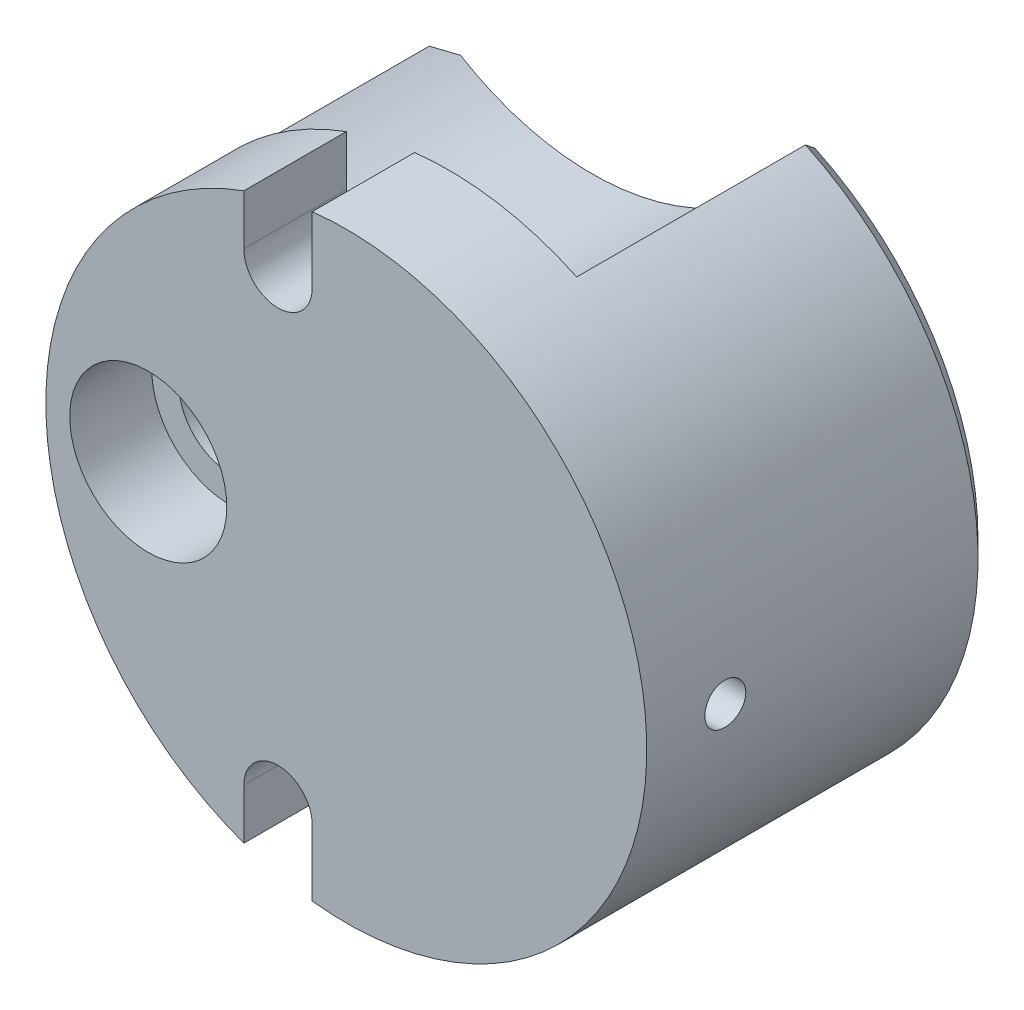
from build123d import *

# Parameters (mm, degrees)
ESQUISSE1_R                  = 44
BASE_EXTRUSION_DEPTH         = 51
CHANFREIN1_SIZE              = 2.5
ENL_V_MAT_EXTRU_1_REACH      = 103.959
ENL_V_MAT_EXTRU_1_END_RADIUS = 15
ESQUISSE4_R                  = 3
ENL_V_START                  = 36
ENL_V_MAT_EXTRU_4_DEPTH      = 36
ENL_V_MAT_EXTRU_3_REACH      = 73.889


with BuildPart() as part:
    # Esquisse1 → Base-Extrusion (new body)
    with BuildSketch(Plane.XY):
        Circle(ESQUISSE1_R)
    extrude(amount=-BASE_EXTRUSION_DEPTH)

    # Esquisse2 → Enl_vement de mati_re-R_volution1 (revolve, cut)
    with BuildSketch(Plane(origin=(0, 0, 0), x_dir=(1, 0, 0), z_dir=(0, 1, 0))):
        Polygon((-5, 51), (-5, 45), (-8, 45), (-8, 43), (-3.5, 43), (-3.5, 19), (-5.5, 19), (-5.5, 17), (1.5, 17), (1.5, 7), (16.5, 7), (16.5, 51), align=None)
    revolve(axis=Axis((16.5, 0, -5), (0, 0, 1)), mode=Mode.SUBTRACT)

    # Esquisse3 → Enl_vement de mati_re-R_volution2 (revolve, cut)
    with BuildSketch(Plane(origin=(0, 0, 0), x_dir=(1, 0, 0), z_dir=(0, 1, 0))):
        Polygon((-29, 51), (-29, 0), (-17.5, 0), (-17.5, 12), (-21.5, 12), (-21.5, 22), (-19, 22), (-19, 51), align=None)
    revolve(axis=Axis((-29, 0, 25), (0, 0, -1)), mode=Mode.SUBTRACT)

    # Chanfrein1
    chanfrein1_edges = [part.edges().sort_by_distance(p)[0] for p in [
        (-44, 0, -51),
    ]]
    chamfer(chanfrein1_edges, length=CHANFREIN1_SIZE)

    # Enl_v. mat.-Extru.1: up to this cylinder (the profile starts outside it)
    enl_v_mat_extru_1_end = Plane(origin=(16.5, 0, -11.5), z_dir=(0, 0, -1)) * Cylinder(ENL_V_MAT_EXTRU_1_END_RADIUS, 238.918, mode=Mode.PRIVATE)
    # Esquisse4 → Enl_v. mat.-Extru.1 (cut, up to the surface)
    with BuildSketch(Plane(origin=(44, 0, -24.25), x_dir=(0, 1, 0), z_dir=(1, 0, 0)), mode=Mode.PRIVATE) as enl_v_mat_extru_1_sk1:
        with Locations(Location((0, 12.75, 0), (0, 0, 270))):
            Circle(ESQUISSE4_R)
    enl_v_mat_extru_1_tool1 = extrude(enl_v_mat_extru_1_sk1.sketch, amount=-ENL_V_MAT_EXTRU_1_REACH, mode=Mode.PRIVATE) - enl_v_mat_extru_1_end
    add(enl_v_mat_extru_1_tool1.solids().sort_by_distance((44, 0, -11.5))[0], mode=Mode.SUBTRACT)

    # Esquisse5 → Enl_v. mat.-Extru.4 (cut)
    with BuildSketch(Plane.XY.offset(-51).offset(ENL_V_START)):
        with BuildLine():
            ThreePointArc((-36.355299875, 24.784918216), (-5.264655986, 19.303738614), (18.738376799, 39.8104664))
            ThreePointArc((18.738376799, 39.8104664), (-11.577165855, 42.449608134), (-36.355299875, 24.784918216))
        make_face()
        with BuildLine():
            ThreePointArc((18.738376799, -39.8104664), (-5.264655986, -19.303738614), (-36.355299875, -24.784918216))
            ThreePointArc((-36.355299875, -24.784918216), (-11.577165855, -42.449608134), (18.738376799, -39.8104664))
        make_face()
    extrude(amount=-ENL_V_MAT_EXTRU_4_DEPTH, mode=Mode.SUBTRACT)

    # Esquisse6 → Enl_v. mat.-Extru.3 (cut, up to next)
    with BuildSketch(Plane(origin=(0, 0, -15), x_dir=(-1, 0, 0), z_dir=(0, 0, -1)), mode=Mode.PRIVATE) as enl_v_mat_extru_3_sk1:
        with BuildLine():
            Line((15, 41.36423576), (15, 34))
            ThreePointArc((15, 34), (10, 29), (5, 34))
            Line((5, 34), (5, 43.714985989))
            ThreePointArc((5, 43.714985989), (10.068838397, 42.832446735), (15, 41.36423576))
        make_face()
    enl_v_mat_extru_3_tool1 = extrude(enl_v_mat_extru_3_sk1.sketch, amount=-ENL_V_MAT_EXTRU_3_REACH, mode=Mode.PRIVATE) & part.part
    # Esquisse6 → Enl_v. mat.-Extru.3 (cut, up to next)
    with BuildSketch(Plane(origin=(0, 0, -15), x_dir=(-1, 0, 0), z_dir=(0, 0, -1)), mode=Mode.PRIVATE) as enl_v_mat_extru_3_sk2:
        with BuildLine():
            Line((15, -34), (15, -41.36423576))
            ThreePointArc((15, -41.36423576), (10.068838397, -42.832446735), (5, -43.714985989))
            Line((5, -43.714985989), (5, -34))
            ThreePointArc((5, -34), (10, -29), (15, -34))
        make_face()
    enl_v_mat_extru_3_tool2 = extrude(enl_v_mat_extru_3_sk2.sketch, amount=-ENL_V_MAT_EXTRU_3_REACH, mode=Mode.PRIVATE) & part.part
    add(enl_v_mat_extru_3_tool1.solids().sort_by_distance((-9.845868, 36.378648, -15))[0], mode=Mode.SUBTRACT)
    add(enl_v_mat_extru_3_tool2.solids().sort_by_distance((-9.845868, -36.378648, -15))[0], mode=Mode.SUBTRACT)


solid = part.part
